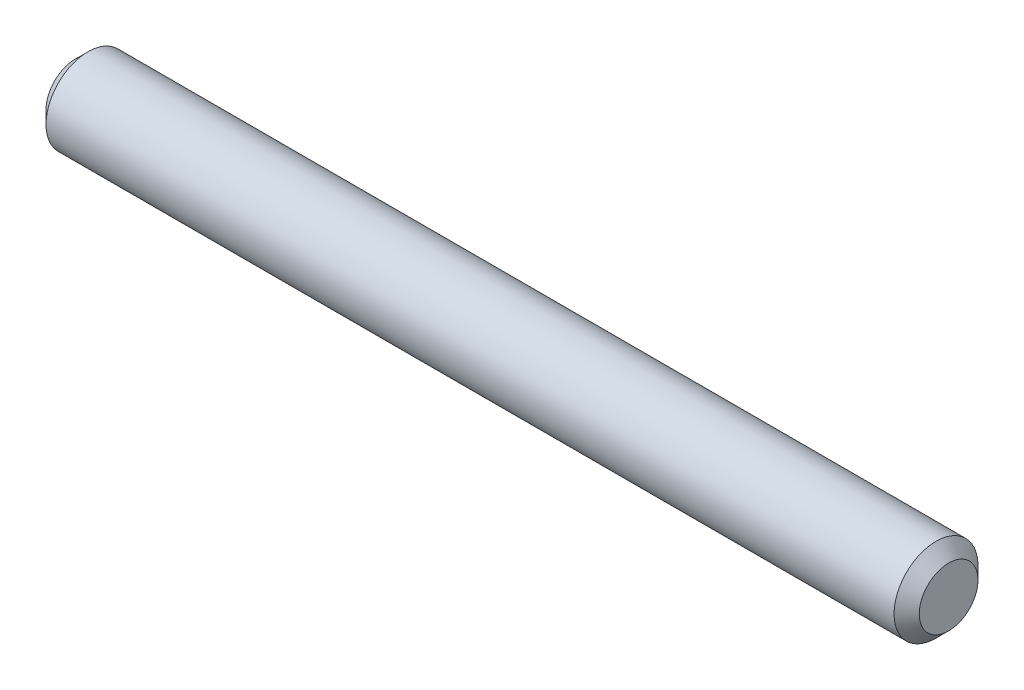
from build123d import *


with BuildPart() as part:
    # Sketch1 → Revolve1 (revolve)
    with BuildSketch(Plane(origin=(0, 0, 0), x_dir=(-1, 0, 0), z_dir=(0, 0, -1)), mode=Mode.PRIVATE) as revolve1_sk:
        Polygon((-10.4, 0.699991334), (-10.4, 0), (10.4, 0), (10.4, 0.699991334), (10.09998762, 1), (-10.09998762, 1), align=None)
    revolve(revolve1_sk.sketch.rotate(Axis((10.4, 0, 0), (-1, 0, 0)), 270), axis=Axis((10.4, 0, 0), (-1, 0, 0)))


solid = part.part
